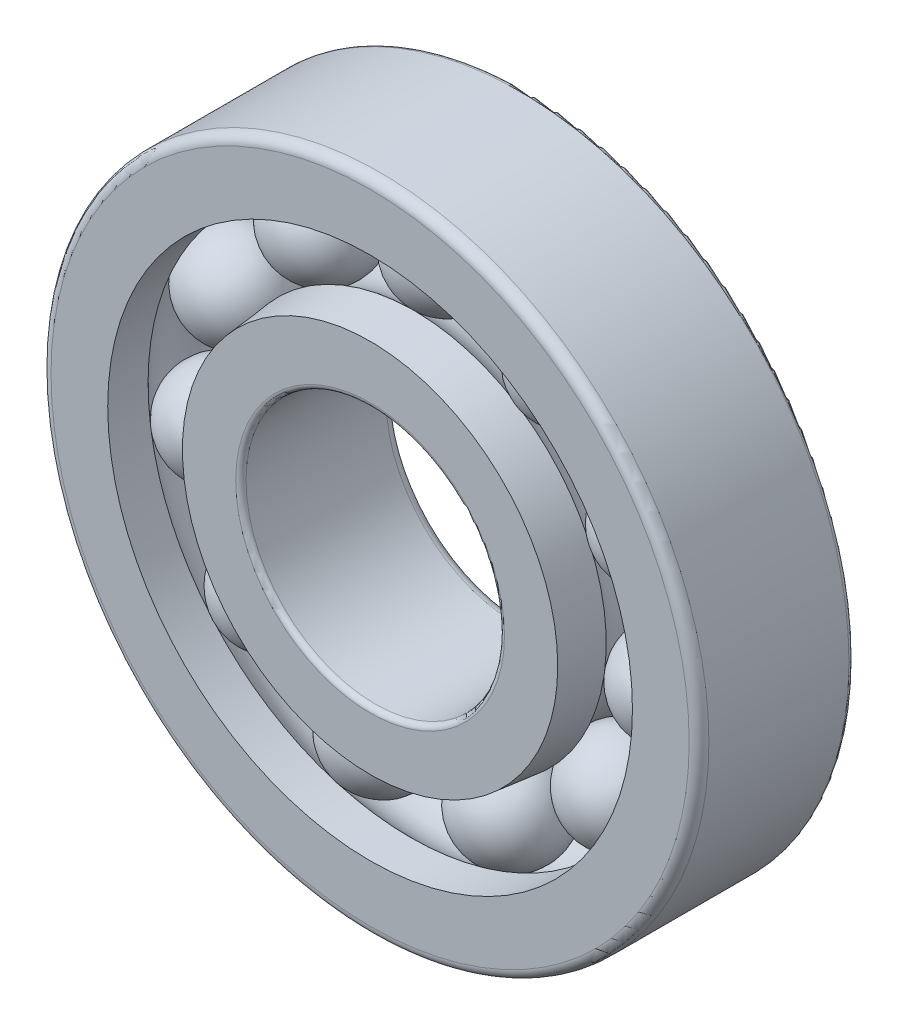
from build123d import *

# Parameters (mm, degrees)
FILLET1_R            = 2.1
FILLET2_R            = 1.1
CIRPATTERNBALL_COUNT = 11


with BuildPart() as part:
    # BaseSke → Ball (revolve)
    with BuildSketch(Plane(origin=(0, 0, 0), x_dir=(0, 0, -1), z_dir=(1, 0, 0))):
        with BuildLine():
            Line((0, 59.375), (0, 38.125))
            ThreePointArc((0, 38.125), (-10.625, 48.75), (0, 59.375))
        make_face()
    ball = revolve(axis=Axis((0, 59.375, 0), (0, -1, 0)))

    # OuterRaceSke → OuterRace (revolve)
    with BuildSketch(Plane(origin=(0, 0, 0), x_dir=(0, 0, -1), z_dir=(1, 0, 0)), mode=Mode.PRIVATE) as outerrace_sk:
        with BuildLine():
            Line((-16.5, 70), (16.5, 70))
            Line((16.5, 70), (16.5, 57.567553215))
            Line((16.5, 57.567553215), (7.160727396, 56.58595611))
            ThreePointArc((7.160727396, 56.58595611), (-0.529587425, 59.351781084), (-7.905985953, 55.833333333))
            Line((-7.905985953, 55.833333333), (-16.5, 55.833333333))
            Line((-16.5, 55.833333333), (-16.5, 70))
        make_face()
    revolve(outerrace_sk.sketch.rotate(Axis((0, 0, 50.391616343), (0, 0, -1)), 90), axis=Axis((0, 0, 50.391616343), (0, 0, -1)))

    # InnerRaceSke → InnerRace (revolve)
    with BuildSketch(Plane(origin=(0, 0, 0), x_dir=(0, 0, -1), z_dir=(1, 0, 0)), mode=Mode.PRIVATE) as innerrace_sk:
        with BuildLine():
            Line((-16.5, 27.5), (16.5, 27.5))
            Line((16.5, 27.5), (16.5, 41.666666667))
            Line((16.5, 41.666666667), (7.905985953, 41.666666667))
            ThreePointArc((7.905985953, 41.666666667), (0, 38.135), (-7.905985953, 41.666666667))
            Line((-7.905985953, 41.666666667), (-16.5, 41.666666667))
            Line((-16.5, 41.666666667), (-16.5, 27.5))
        make_face()
    revolve(innerrace_sk.sketch.rotate(Axis((0, 0, 70.862590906), (0, 0, -1)), 90), axis=Axis((0, 0, 70.862590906), (0, 0, -1)))

    # Fillet1
    fillet1_edges = [part.edges().sort_by_distance(p)[0] for p in [
        (-27.5, 0, -16.5),
        (-70, 0, 16.5),
    ]]
    fillet(fillet1_edges, radius=FILLET1_R)

    # Fillet2
    fillet2_edges = [part.edges().sort_by_distance(p)[0] for p in [
        (-27.5, 0, 16.5),
        (-70, 0, -16.5),
    ]]
    fillet(fillet2_edges, radius=FILLET2_R)

    # CutInnerRaceSke → CutInnerRace (revolve, cut)
    with BuildSketch(Plane(origin=(0, 0, 0), x_dir=(0, 0, -1), z_dir=(1, 0, 0)), mode=Mode.PRIVATE) as cutinnerrace_sk:
        with BuildLine():
            Line((-7.905985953, 41.666666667), (-16.5, 41.666666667))
            Line((-16.5, 41.666666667), (-16.5, 39.932446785))
            Line((-16.5, 39.932446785), (-7.160727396, 40.91404389))
            ThreePointArc((-7.160727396, 40.91404389), (-7.542749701, 41.28105416), (-7.905985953, 41.666666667))
        make_face()
    revolve(cutinnerrace_sk.sketch.rotate(Axis((0, 0, 28.306583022), (0, 0, -1)), 270), axis=Axis((0, 0, 28.306583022), (0, 0, -1)), mode=Mode.SUBTRACT)

    # CirPatternBall: Ball ×11 about axis
    cirpatternball_axis = Axis((0, 0, 0), (0, 0, 1))
    for i in range(1, CIRPATTERNBALL_COUNT):
        add(ball.rotate(cirpatternball_axis, i * 360 / CIRPATTERNBALL_COUNT))


solid = part.part
